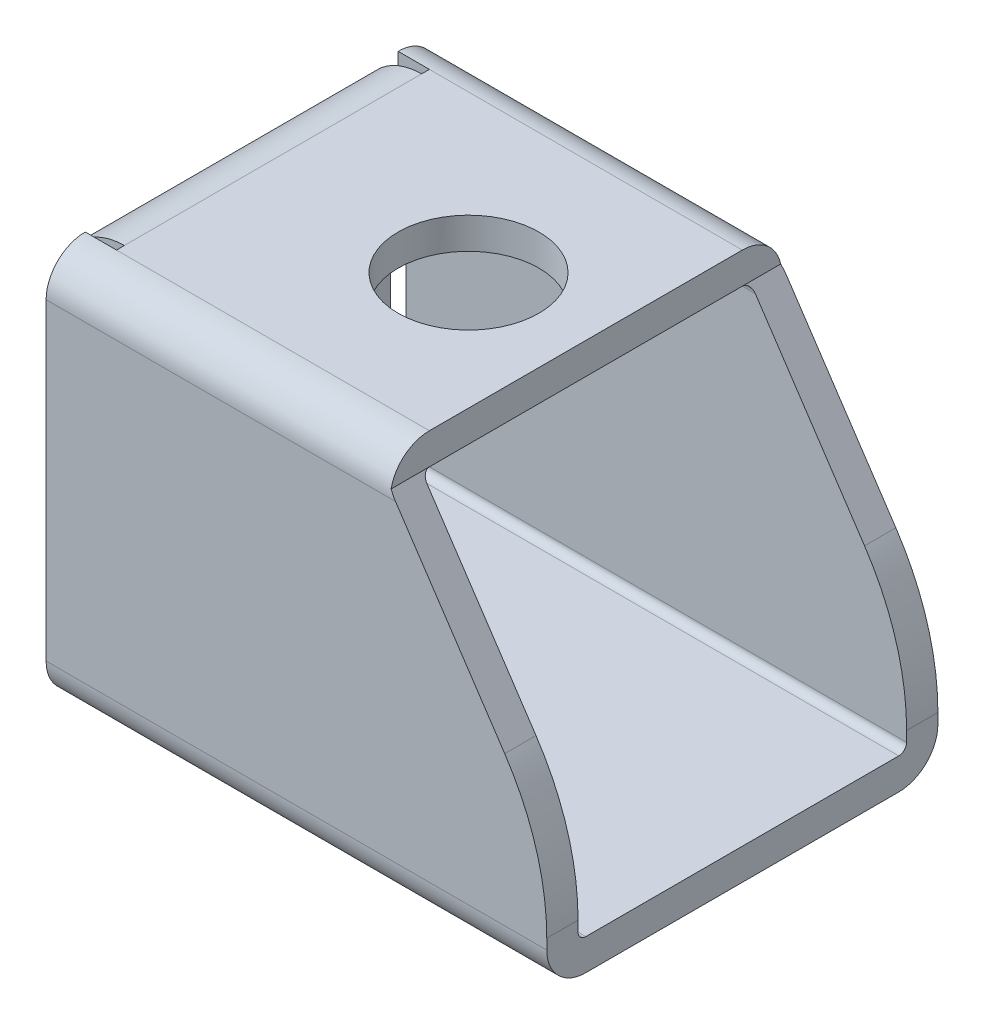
from build123d import *

# Parameters (mm, degrees)
BOSS_EXTRU_1_DEPTH           = 32
ENL_V_MAT_EXTRU_1_DEPTH      = 43.488233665
ENL_V_MAT_EXTRU_1_DEPTH_BACK = 43.488233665
CONG_1_R                     = 16
ESQUISSE3_W                  = 20
ESQUISSE3_H                  = 2
ENL_V_MAT_EXTRU_2_DEPTH      = 2
ESQUISSE5_W                  = 19
ESQUISSE5_H                  = 2
ENL_V_MAT_EXTRU_3_REACH      = 44.488
ESQUISSE6_R                  = 4.5


with BuildPart() as part:
    # Esquisse1 → Boss.-Extru.1 (new body)
    with BuildSketch(Plane(origin=(0, 0, 0), x_dir=(0, 0, -1), z_dir=(1, 0, 0))):
        with BuildLine():
            Line((-10, 12.5), (10, 12.5))
            ThreePointArc((10, 12.5), (11.767766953, 11.767766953), (12.5, 10))
            Line((12.5, 10), (12.5, -10))
            ThreePointArc((12.5, -10), (11.767766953, -11.767766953), (10, -12.5))
            Line((10, -12.5), (-10, -12.5))
            ThreePointArc((-10, -12.5), (-11.767766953, -11.767766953), (-12.5, -10))
            Line((-12.5, -10), (-12.5, 10))
            ThreePointArc((-12.5, 10), (-11.767766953, 11.767766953), (-10, 12.5))
        make_face()
        with BuildLine():
            Line((-10, 10.5), (10, 10.5))
            ThreePointArc((10, 10.5), (10.353553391, 10.353553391), (10.5, 10))
            Line((10.5, 10), (10.5, -10))
            ThreePointArc((10.5, -10), (10.353553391, -10.353553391), (10, -10.5))
            Line((10, -10.5), (-10, -10.5))
            ThreePointArc((-10, -10.5), (-10.353553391, -10.353553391), (-10.5, -10))
            Line((-10.5, -10), (-10.5, 10))
            ThreePointArc((-10.5, 10), (-10.353553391, 10.353553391), (-10, 10.5))
        make_face(mode=Mode.SUBTRACT)
    extrude(amount=BOSS_EXTRU_1_DEPTH)

    # Esquisse2 → Enl_v. mat.-Extru.1 (cut, two sides: drawn at the far end of the back side and taken through both)
    with BuildSketch(Plane.XY.offset(12.5).offset(-ENL_V_MAT_EXTRU_1_DEPTH_BACK)):
        Polygon((22, 94.970683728), (22, 12.5), (22, 10.5), (32, -4.5), (77.746504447, -73.11975667), (234.30269798, -21.198537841), (178.556193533, 146.891902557), align=None)
    extrude(amount=ENL_V_MAT_EXTRU_1_DEPTH + ENL_V_MAT_EXTRU_1_DEPTH_BACK, mode=Mode.SUBTRACT)

    # Cong_1
    cong_1_edges = [part.edges().sort_by_distance(p)[0] for p in [
        (32, -4.5, -11.5),
        (32, -4.5, 11.5),
    ]]
    fillet(cong_1_edges, radius=CONG_1_R)

    # Esquisse3 → Enl_v. mat.-Extru.2 (cut)
    with BuildSketch(Plane.ZY):
        with Locations((0, 11.5)):
            Rectangle(ESQUISSE3_W, ESQUISSE3_H)
    extrude(amount=-ENL_V_MAT_EXTRU_2_DEPTH, mode=Mode.SUBTRACT)

    # Balayage3: sweep along a path in Esquisse4
    with BuildLine(Plane.XY) as balayage3_path:
        Line((0, -9), (0, 8.5))
        ThreePointArc((0, 8.5), (0.585786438, 9.914213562), (2, 10.5))
    # Esquisse5 → Balayage3 (sweep)
    with BuildSketch(Plane.ZY.offset(-2)):
        with Locations((0, 11.5)):
            Rectangle(ESQUISSE5_W, ESQUISSE5_H)
    sweep(path=balayage3_path.line)

    # Esquisse6 → Enl_v. mat.-Extru.3 (cut, up to next)
    with BuildSketch(Plane(origin=(0, 12.5, 0), x_dir=(1, 0, 0), z_dir=(0, 1, 0)), mode=Mode.PRIVATE) as enl_v_mat_extru_3_sk1:
        with Locations(Location((14.5, 0, 0), (0, 0, 270))):
            Circle(ESQUISSE6_R)
    enl_v_mat_extru_3_tool1 = extrude(enl_v_mat_extru_3_sk1.sketch, amount=-ENL_V_MAT_EXTRU_3_REACH, mode=Mode.PRIVATE) & part.part
    add(enl_v_mat_extru_3_tool1.solids().sort_by_distance((14.5, 12.5, 0))[0], mode=Mode.SUBTRACT)


solid = part.part
